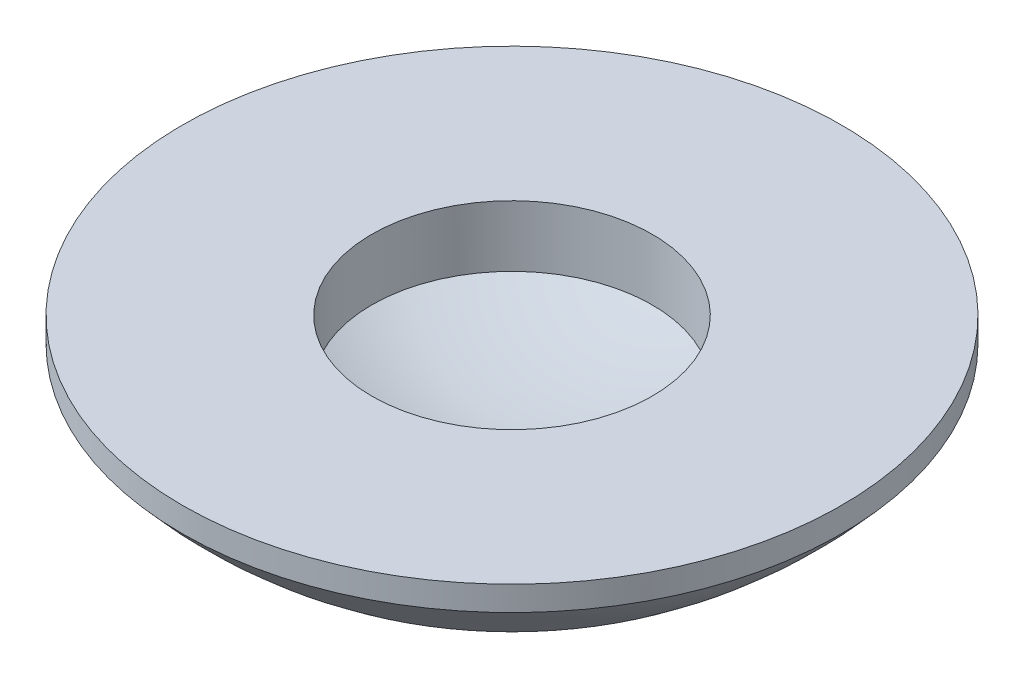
from build123d import *


with BuildPart() as part:
    # Sketch1 → Revolve2 (revolve)
    with BuildSketch(Plane.XY):
        with BuildLine():
            Line((0, -1.607325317), (0, -1.907325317))
            ThreePointArc((0, -1.907325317), (-0.630785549, -1.768247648), (-1.144600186, -1.376804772))
            Line((-1.144600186, -1.376804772), (-1.144600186, -1.291448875))
            Line((-1.144600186, -1.291448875), (-0.487159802, -1.291448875))
            Line((-0.487159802, -1.291448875), (-0.487159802, -1.403990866))
            Line((-0.487159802, -1.403990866), (-0.487159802, -1.503990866))
            ThreePointArc((-0.487159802, -1.503990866), (-0.248999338, -1.581207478), (0, -1.607325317))
        make_face()
    revolve(axis=Axis((0, -1.607325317, 0), (0, -1, 0)))


solid = part.part
